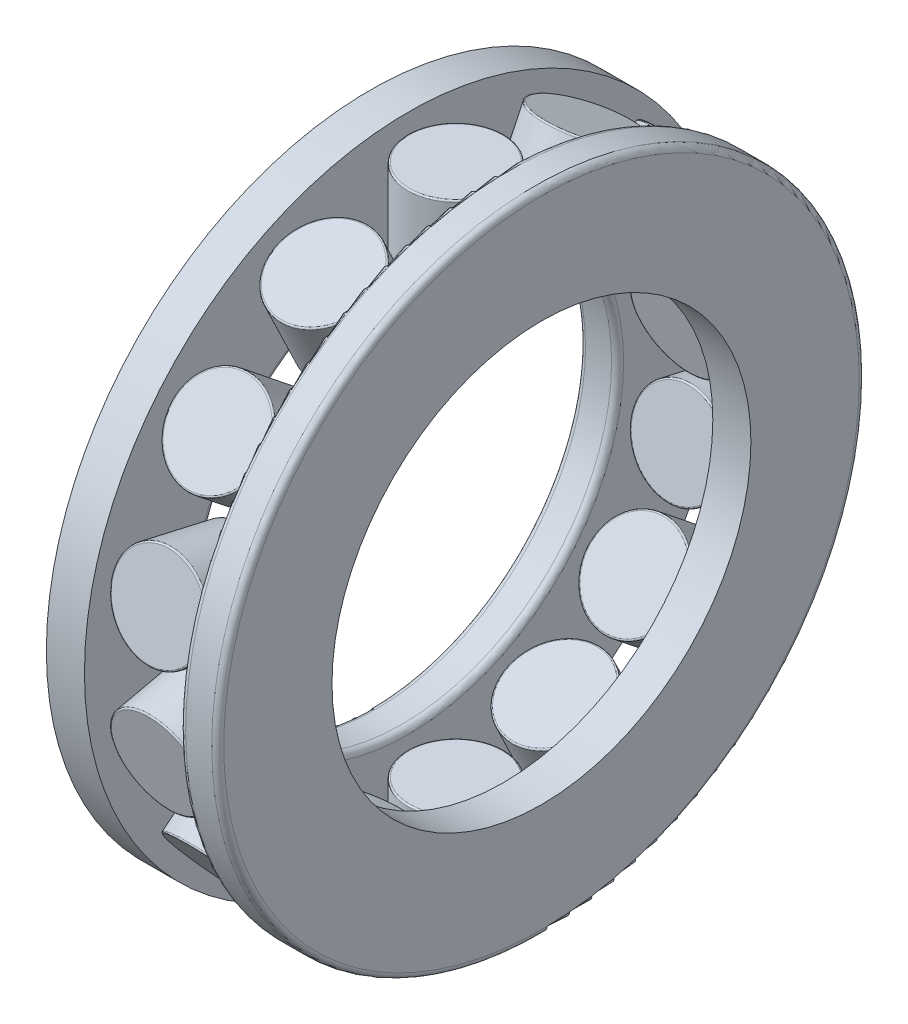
from build123d import *

# Parameters (mm, degrees)
INNRACSKE_W           = 6.35
INNRACSKE_H           = 19.05
FILLET_2_R            = 1
ROLLERSDETAILED_COUNT = 14
ROLLERSDETAILED_ANGLE = 334.285714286


with BuildPart() as part:
    # InnRacSke → Race (revolve)
    with BuildSketch(Plane.XY, mode=Mode.PRIVATE) as race_sk:
        with Locations((-11.1125, 44.45)):
            Rectangle(INNRACSKE_W, INNRACSKE_H)
    race = revolve(race_sk.sketch.rotate(Axis((-34.925, 0, 0), (1, 0, 0)), 270), axis=Axis((-34.925, 0, 0), (1, 0, 0)))

    # RolDetSke → RollerDetailed (revolve)
    with BuildSketch(Plane.XY, mode=Mode.PRIVATE) as rollerdetailed_sk:
        with BuildLine():
            Line((0, 50.8), (7.7231875, 50.8))
            ThreePointArc((7.7231875, 50.8), (7.902792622, 50.725605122), (7.9771875, 50.546))
            Line((7.9771875, 50.546), (7.9771875, 38.354))
            ThreePointArc((7.9771875, 38.354), (7.902792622, 38.174394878), (7.7231875, 38.1))
            Line((7.7231875, 38.1), (0, 38.1))
            Line((0, 38.1), (0, 50.8))
        make_face()
    rollerdetailed = revolve(rollerdetailed_sk.sketch.rotate(Axis((0, 33.02, 0), (0, 1, 0)), 270), axis=Axis((0, 33.02, 0), (0, 1, 0)))

    # Mirror1: Race across plane
    add(race.mirror(Plane(origin=(0, 0, 0), x_dir=(0, 0, 1), z_dir=(1, 0, 0))))

    # Fillet 2
    fillet_2_edges = [part.edges().sort_by_distance(p)[0] for p in [
        (7.9375, 0, 53.975),
        (14.2875, 0, 53.975),
        (-7.9375, 0, 34.925),
        (-14.2875, 0, 34.925),
    ]]
    fillet(fillet_2_edges, radius=FILLET_2_R)

    # RollersDetailed: RollerDetailed ×14 about axis
    rollersdetailed_axis = Axis((-50, 0, 0), (1, 0, 0))
    for i in range(1, ROLLERSDETAILED_COUNT):
        add(rollerdetailed.rotate(rollersdetailed_axis, i * ROLLERSDETAILED_ANGLE / (ROLLERSDETAILED_COUNT - 1)))


solid = part.part
